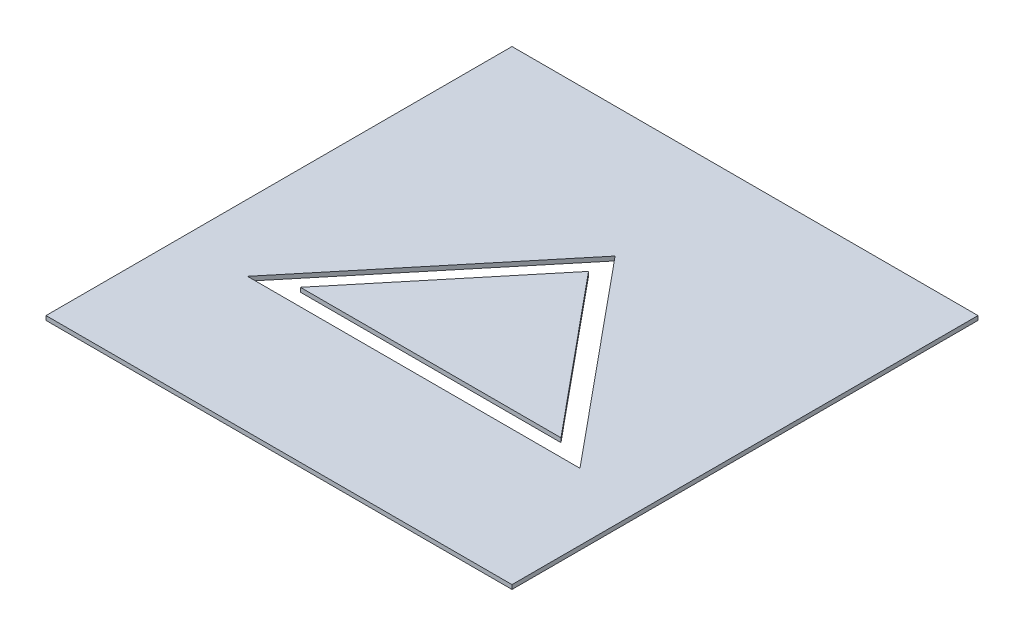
ISO-10303-21;
HEADER;
FILE_DESCRIPTION(('STEP AP214'),'2;1');
FILE_NAME('part.step','',(''),(''),'','','');
FILE_SCHEMA(('AUTOMOTIVE_DESIGN { 1 0 10303 214 1 1 1 1 }'));
ENDSEC;
DATA;
#1=APPLICATION_CONTEXT('core data for automotive mechanical design processes');
#2=APPLICATION_PROTOCOL_DEFINITION('international standard','automotive_design',2000,#1);
#3=PRODUCT_CONTEXT('',#1,'mechanical');
#4=PRODUCT('Part','Part','',(#3));
#5=PRODUCT_RELATED_PRODUCT_CATEGORY('part','',(#4));
#6=PRODUCT_DEFINITION_FORMATION('','',#4);
#7=PRODUCT_DEFINITION_CONTEXT('part definition',#1,'design');
#8=PRODUCT_DEFINITION('design','',#6,#7);
#9=PRODUCT_DEFINITION_SHAPE('','',#8);
#10=(LENGTH_UNIT() NAMED_UNIT(*) SI_UNIT(.MILLI.,.METRE.));
#11=(NAMED_UNIT(*) PLANE_ANGLE_UNIT() SI_UNIT($,.RADIAN.));
#12=(NAMED_UNIT(*) SI_UNIT($,.STERADIAN.) SOLID_ANGLE_UNIT());
#13=UNCERTAINTY_MEASURE_WITH_UNIT(LENGTH_MEASURE(1.E-05),#10,'distance_accuracy_value','');
#14=(GEOMETRIC_REPRESENTATION_CONTEXT(3) GLOBAL_UNCERTAINTY_ASSIGNED_CONTEXT((#13)) GLOBAL_UNIT_ASSIGNED_CONTEXT((#10,
#11,#12)) REPRESENTATION_CONTEXT('',''));
#15=CARTESIAN_POINT('',(0.,0.,0.));
#16=DIRECTION('',(0.,0.,1.));
#17=DIRECTION('',(1.,0.,0.));
#18=AXIS2_PLACEMENT_3D('',#15,#16,#17);
#19=CARTESIAN_POINT('',(0.,2.54,-90.932));
#20=DIRECTION('',(0.,0.,-1.));
#21=DIRECTION('',(-1.,0.,0.));
#22=AXIS2_PLACEMENT_3D('',#19,#20,#21);
#23=PLANE('',#22);
#24=DIRECTION('',(1.,0.,0.));
#25=VECTOR('',#24,1.);
#26=CARTESIAN_POINT('',(0.,0.,-90.932));
#27=LINE('',#26,#25);
#28=CARTESIAN_POINT('',(-217.81910630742,0.,-90.932));
#29=VERTEX_POINT('',#28);
#30=CARTESIAN_POINT('',(-61.5808936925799,0.,-90.932));
#31=VERTEX_POINT('',#30);
#32=EDGE_CURVE('E113',#29,#31,#27,.T.);
#33=ORIENTED_EDGE('',*,*,#32,.T.);
#34=DIRECTION('',(0.,-1.,0.));
#35=VECTOR('',#34,1.);
#36=CARTESIAN_POINT('',(-61.5808936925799,2.54,-90.932));
#37=LINE('',#36,#35);
#38=CARTESIAN_POINT('',(-61.5808936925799,2.54,-90.932));
#39=VERTEX_POINT('',#38);
#40=EDGE_CURVE('E13',#39,#31,#37,.T.);
#41=ORIENTED_EDGE('',*,*,#40,.F.);
#42=DIRECTION('',(1.,0.,0.));
#43=VECTOR('',#42,1.);
#44=CARTESIAN_POINT('',(0.,2.54,-90.932));
#45=LINE('',#44,#43);
#46=CARTESIAN_POINT('',(-217.81910630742,2.54,-90.932));
#47=VERTEX_POINT('',#46);
#48=EDGE_CURVE('E106',#47,#39,#45,.T.);
#49=ORIENTED_EDGE('',*,*,#48,.F.);
#50=DIRECTION('',(0.,-1.,0.));
#51=VECTOR('',#50,1.);
#52=CARTESIAN_POINT('',(-217.81910630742,2.54,-90.932));
#53=LINE('',#52,#51);
#54=EDGE_CURVE('E114',#47,#29,#53,.T.);
#55=ORIENTED_EDGE('',*,*,#54,.T.);
#56=EDGE_LOOP('',(#33,#41,#49,#55));
#57=FACE_BOUND('',#56,.T.);
#58=ADVANCED_FACE('F66',(#57),#23,.F.);
#59=CARTESIAN_POINT('',(8.01939738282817,2.54,-6.62008948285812));
#60=DIRECTION('',(-0.771180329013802,0.,0.636616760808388));
#61=DIRECTION('',(0.636616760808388,0.,0.771180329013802));
#62=AXIS2_PLACEMENT_3D('',#59,#60,#61);
#63=PLANE('',#62);
#64=DIRECTION('',(-0.636616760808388,0.,-0.771180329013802));
#65=VECTOR('',#64,1.);
#66=CARTESIAN_POINT('',(8.01939738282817,0.,-6.62008948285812));
#67=LINE('',#66,#65);
#68=CARTESIAN_POINT('',(-139.7,0.,-185.56337292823));
#69=VERTEX_POINT('',#68);
#70=EDGE_CURVE('E94',#31,#69,#67,.T.);
#71=ORIENTED_EDGE('',*,*,#70,.T.);
#72=DIRECTION('',(0.,-1.,0.));
#73=VECTOR('',#72,1.);
#74=CARTESIAN_POINT('',(-139.7,2.54,-185.56337292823));
#75=LINE('',#74,#73);
#76=CARTESIAN_POINT('',(-139.7,2.54,-185.56337292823));
#77=VERTEX_POINT('',#76);
#78=EDGE_CURVE('E74',#77,#69,#75,.T.);
#79=ORIENTED_EDGE('',*,*,#78,.F.);
#80=DIRECTION('',(-0.636616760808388,0.,-0.771180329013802));
#81=VECTOR('',#80,1.);
#82=CARTESIAN_POINT('',(8.01939738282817,2.54,-6.62008948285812));
#83=LINE('',#82,#81);
#84=EDGE_CURVE('E102',#39,#77,#83,.T.);
#85=ORIENTED_EDGE('',*,*,#84,.F.);
#86=ORIENTED_EDGE('',*,*,#40,.T.);
#87=EDGE_LOOP('',(#71,#79,#85,#86));
#88=FACE_BOUND('',#87,.T.);
#89=ADVANCED_FACE('F103',(#88),#63,.F.);
#90=CARTESIAN_POINT('',(-174.183913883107,2.54,-143.79049214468));
#91=DIRECTION('',(0.771180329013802,0.,0.636616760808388));
#92=DIRECTION('',(0.636616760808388,0.,-0.771180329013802));
#93=AXIS2_PLACEMENT_3D('',#90,#91,#92);
#94=PLANE('',#93);
#95=DIRECTION('',(-0.636616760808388,0.,0.771180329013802));
#96=VECTOR('',#95,1.);
#97=CARTESIAN_POINT('',(-174.183913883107,0.,-143.79049214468));
#98=LINE('',#97,#96);
#99=EDGE_CURVE('E99',#69,#29,#98,.T.);
#100=ORIENTED_EDGE('',*,*,#99,.T.);
#101=ORIENTED_EDGE('',*,*,#54,.F.);
#102=DIRECTION('',(-0.636616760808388,0.,0.771180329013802));
#103=VECTOR('',#102,1.);
#104=CARTESIAN_POINT('',(-174.183913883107,2.54,-143.79049214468));
#105=LINE('',#104,#103);
#106=EDGE_CURVE('E82',#77,#47,#105,.T.);
#107=ORIENTED_EDGE('',*,*,#106,.F.);
#108=ORIENTED_EDGE('',*,*,#78,.T.);
#109=EDGE_LOOP('',(#100,#101,#107,#108));
#110=FACE_BOUND('',#109,.T.);
#111=ADVANCED_FACE('F121',(#110),#94,.F.);
#112=CARTESIAN_POINT('',(0.,2.54,0.));
#113=DIRECTION('',(0.,1.,0.));
#114=DIRECTION('',(0.,0.,1.));
#115=AXIS2_PLACEMENT_3D('',#112,#113,#114);
#116=PLANE('',#115);
#117=ORIENTED_EDGE('',*,*,#48,.T.);
#118=ORIENTED_EDGE('',*,*,#84,.T.);
#119=ORIENTED_EDGE('',*,*,#106,.T.);
#120=EDGE_LOOP('',(#117,#118,#119));
#121=FACE_BOUND('',#120,.T.);
#122=ADVANCED_FACE('F109',(#121),#116,.T.);
#123=CARTESIAN_POINT('',(0.,0.,0.));
#124=DIRECTION('',(0.,1.,0.));
#125=DIRECTION('',(0.,0.,1.));
#126=AXIS2_PLACEMENT_3D('',#123,#124,#125);
#127=PLANE('',#126);
#128=ORIENTED_EDGE('',*,*,#32,.F.);
#129=ORIENTED_EDGE('',*,*,#99,.F.);
#130=ORIENTED_EDGE('',*,*,#70,.F.);
#131=EDGE_LOOP('',(#128,#129,#130));
#132=FACE_BOUND('',#131,.T.);
#133=ADVANCED_FACE('F122',(#132),#127,.F.);
#134=CLOSED_SHELL('',(#58,#89,#111,#122,#133));
#135=MANIFOLD_SOLID_BREP('B2',#134);
#136=CARTESIAN_POINT('',(0.,2.54,-80.772));
#137=DIRECTION('',(0.,0.,1.));
#138=DIRECTION('',(1.,0.,0.));
#139=AXIS2_PLACEMENT_3D('',#136,#137,#138);
#140=PLANE('',#139);
#141=DIRECTION('',(-1.,0.,0.));
#142=VECTOR('',#141,1.);
#143=CARTESIAN_POINT('',(0.,0.,-80.772));
#144=LINE('',#143,#142);
#145=CARTESIAN_POINT('',(-40.0191063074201,0.,-80.772));
#146=VERTEX_POINT('',#145);
#147=CARTESIAN_POINT('',(-239.38089369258,0.,-80.7719999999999));
#148=VERTEX_POINT('',#147);
#149=EDGE_CURVE('E243',#146,#148,#144,.T.);
#150=ORIENTED_EDGE('',*,*,#149,.T.);
#151=DIRECTION('',(0.,-1.,0.));
#152=VECTOR('',#151,1.);
#153=CARTESIAN_POINT('',(-239.38089369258,2.54,-80.7719999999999));
#154=LINE('',#153,#152);
#155=CARTESIAN_POINT('',(-239.38089369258,2.54,-80.7719999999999));
#156=VERTEX_POINT('',#155);
#157=EDGE_CURVE('E64',#156,#148,#154,.T.);
#158=ORIENTED_EDGE('',*,*,#157,.F.);
#159=DIRECTION('',(-1.,0.,0.));
#160=VECTOR('',#159,1.);
#161=CARTESIAN_POINT('',(0.,2.54,-80.772));
#162=LINE('',#161,#160);
#163=CARTESIAN_POINT('',(-40.0191063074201,2.54,-80.772));
#164=VERTEX_POINT('',#163);
#165=EDGE_CURVE('E235',#164,#156,#162,.T.);
#166=ORIENTED_EDGE('',*,*,#165,.F.);
#167=DIRECTION('',(0.,-1.,0.));
#168=VECTOR('',#167,1.);
#169=CARTESIAN_POINT('',(-40.0191063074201,2.54,-80.772));
#170=LINE('',#169,#168);
#171=EDGE_CURVE('E244',#164,#146,#170,.T.);
#172=ORIENTED_EDGE('',*,*,#171,.T.);
#173=EDGE_LOOP('',(#150,#158,#166,#172));
#174=FACE_BOUND('',#173,.T.);
#175=ADVANCED_FACE('F164',(#174),#140,.F.);
#176=CARTESIAN_POINT('',(-182.019106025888,2.54,-150.258518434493));
#177=DIRECTION('',(-0.771180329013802,0.,-0.636616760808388));
#178=DIRECTION('',(-0.636616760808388,0.,0.771180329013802));
#179=AXIS2_PLACEMENT_3D('',#176,#177,#178);
#180=PLANE('',#179);
#181=DIRECTION('',(0.636616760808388,0.,-0.771180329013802));
#182=VECTOR('',#181,1.);
#183=CARTESIAN_POINT('',(-182.019106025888,0.,-150.258518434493));
#184=LINE('',#183,#182);
#185=CARTESIAN_POINT('',(-139.7,0.,-201.522739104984));
#186=VERTEX_POINT('',#185);
#187=EDGE_CURVE('E207',#148,#186,#184,.T.);
#188=ORIENTED_EDGE('',*,*,#187,.T.);
#189=DIRECTION('',(0.,-1.,0.));
#190=VECTOR('',#189,1.);
#191=CARTESIAN_POINT('',(-139.7,2.54,-201.522739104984));
#192=LINE('',#191,#190);
#193=CARTESIAN_POINT('',(-139.7,2.54,-201.522739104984));
#194=VERTEX_POINT('',#193);
#195=EDGE_CURVE('E174',#194,#186,#192,.T.);
#196=ORIENTED_EDGE('',*,*,#195,.F.);
#197=DIRECTION('',(0.636616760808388,0.,-0.771180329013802));
#198=VECTOR('',#197,1.);
#199=CARTESIAN_POINT('',(-182.019106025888,2.54,-150.258518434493));
#200=LINE('',#199,#198);
#201=EDGE_CURVE('E231',#156,#194,#200,.T.);
#202=ORIENTED_EDGE('',*,*,#201,.F.);
#203=ORIENTED_EDGE('',*,*,#157,.T.);
#204=EDGE_LOOP('',(#188,#196,#202,#203));
#205=FACE_BOUND('',#204,.T.);
#206=ADVANCED_FACE('F232',(#205),#180,.F.);
#207=CARTESIAN_POINT('',(-279.4,2.54,0.));
#208=DIRECTION('',(-1.,0.,0.));
#209=DIRECTION('',(0.,0.,1.));
#210=AXIS2_PLACEMENT_3D('',#207,#208,#209);
#211=PLANE('',#210);
#212=DIRECTION('',(0.,0.,-1.));
#213=VECTOR('',#212,1.);
#214=CARTESIAN_POINT('',(-279.4,0.,0.));
#215=LINE('',#214,#213);
#216=CARTESIAN_POINT('',(-279.4,0.,0.));
#217=VERTEX_POINT('',#216);
#218=CARTESIAN_POINT('',(-279.4,0.,-279.4));
#219=VERTEX_POINT('',#218);
#220=EDGE_CURVE('E275',#217,#219,#215,.T.);
#221=ORIENTED_EDGE('',*,*,#220,.F.);
#222=DIRECTION('',(0.,-1.,0.));
#223=VECTOR('',#222,1.);
#224=CARTESIAN_POINT('',(-279.4,2.54,0.));
#225=LINE('',#224,#223);
#226=CARTESIAN_POINT('',(-279.4,2.54,0.));
#227=VERTEX_POINT('',#226);
#228=EDGE_CURVE('E168',#227,#217,#225,.T.);
#229=ORIENTED_EDGE('',*,*,#228,.F.);
#230=DIRECTION('',(0.,0.,-1.));
#231=VECTOR('',#230,1.);
#232=CARTESIAN_POINT('',(-279.4,2.54,0.));
#233=LINE('',#232,#231);
#234=CARTESIAN_POINT('',(-279.4,2.54,-279.4));
#235=VERTEX_POINT('',#234);
#236=EDGE_CURVE('E255',#227,#235,#233,.T.);
#237=ORIENTED_EDGE('',*,*,#236,.T.);
#238=DIRECTION('',(0.,-1.,0.));
#239=VECTOR('',#238,1.);
#240=CARTESIAN_POINT('',(-279.4,2.54,-279.4));
#241=LINE('',#240,#239);
#242=EDGE_CURVE('E258',#235,#219,#241,.T.);
#243=ORIENTED_EDGE('',*,*,#242,.T.);
#244=EDGE_LOOP('',(#221,#229,#237,#243));
#245=FACE_BOUND('',#244,.T.);
#246=ADVANCED_FACE('F166',(#245),#211,.T.);
#247=CARTESIAN_POINT('',(0.,2.54,0.));
#248=DIRECTION('',(0.,0.,1.));
#249=DIRECTION('',(1.,0.,0.));
#250=AXIS2_PLACEMENT_3D('',#247,#248,#249);
#251=PLANE('',#250);
#252=DIRECTION('',(-1.,0.,0.));
#253=VECTOR('',#252,1.);
#254=CARTESIAN_POINT('',(0.,0.,0.));
#255=LINE('',#254,#253);
#256=CARTESIAN_POINT('',(0.,0.,0.));
#257=VERTEX_POINT('',#256);
#258=EDGE_CURVE('E271',#257,#217,#255,.T.);
#259=ORIENTED_EDGE('',*,*,#258,.F.);
#260=DIRECTION('',(0.,-1.,0.));
#261=VECTOR('',#260,1.);
#262=CARTESIAN_POINT('',(0.,2.54,0.));
#263=LINE('',#262,#261);
#264=CARTESIAN_POINT('',(0.,2.54,0.));
#265=VERTEX_POINT('',#264);
#266=EDGE_CURVE('E262',#265,#257,#263,.T.);
#267=ORIENTED_EDGE('',*,*,#266,.F.);
#268=DIRECTION('',(-1.,0.,0.));
#269=VECTOR('',#268,1.);
#270=CARTESIAN_POINT('',(0.,2.54,0.));
#271=LINE('',#270,#269);
#272=EDGE_CURVE('E273',#265,#227,#271,.T.);
#273=ORIENTED_EDGE('',*,*,#272,.T.);
#274=ORIENTED_EDGE('',*,*,#228,.T.);
#275=EDGE_LOOP('',(#259,#267,#273,#274));
#276=FACE_BOUND('',#275,.T.);
#277=ADVANCED_FACE('F269',(#276),#251,.T.);
#278=CARTESIAN_POINT('',(0.,2.54,0.));
#279=DIRECTION('',(-1.,0.,0.));
#280=DIRECTION('',(0.,0.,1.));
#281=AXIS2_PLACEMENT_3D('',#278,#279,#280);
#282=PLANE('',#281);
#283=DIRECTION('',(0.,0.,-1.));
#284=VECTOR('',#283,1.);
#285=CARTESIAN_POINT('',(0.,0.,0.));
#286=LINE('',#285,#284);
#287=CARTESIAN_POINT('',(0.,0.,-279.4));
#288=VERTEX_POINT('',#287);
#289=EDGE_CURVE('E250',#257,#288,#286,.T.);
#290=ORIENTED_EDGE('',*,*,#289,.T.);
#291=DIRECTION('',(0.,-1.,0.));
#292=VECTOR('',#291,1.);
#293=CARTESIAN_POINT('',(0.,2.54,-279.4));
#294=LINE('',#293,#292);
#295=CARTESIAN_POINT('',(0.,2.54,-279.4));
#296=VERTEX_POINT('',#295);
#297=EDGE_CURVE('E260',#296,#288,#294,.T.);
#298=ORIENTED_EDGE('',*,*,#297,.F.);
#299=DIRECTION('',(0.,0.,-1.));
#300=VECTOR('',#299,1.);
#301=CARTESIAN_POINT('',(0.,2.54,0.));
#302=LINE('',#301,#300);
#303=EDGE_CURVE('E285',#265,#296,#302,.T.);
#304=ORIENTED_EDGE('',*,*,#303,.F.);
#305=ORIENTED_EDGE('',*,*,#266,.T.);
#306=EDGE_LOOP('',(#290,#298,#304,#305));
#307=FACE_BOUND('',#306,.T.);
#308=ADVANCED_FACE('F293',(#307),#282,.F.);
#309=CARTESIAN_POINT('',(0.,2.54,-279.4));
#310=DIRECTION('',(0.,0.,1.));
#311=DIRECTION('',(1.,0.,0.));
#312=AXIS2_PLACEMENT_3D('',#309,#310,#311);
#313=PLANE('',#312);
#314=DIRECTION('',(-1.,0.,0.));
#315=VECTOR('',#314,1.);
#316=CARTESIAN_POINT('',(0.,0.,-279.4));
#317=LINE('',#316,#315);
#318=EDGE_CURVE('E246',#288,#219,#317,.T.);
#319=ORIENTED_EDGE('',*,*,#318,.T.);
#320=ORIENTED_EDGE('',*,*,#242,.F.);
#321=DIRECTION('',(-1.,0.,0.));
#322=VECTOR('',#321,1.);
#323=CARTESIAN_POINT('',(0.,2.54,-279.4));
#324=LINE('',#323,#322);
#325=EDGE_CURVE('E240',#296,#235,#324,.T.);
#326=ORIENTED_EDGE('',*,*,#325,.F.);
#327=ORIENTED_EDGE('',*,*,#297,.T.);
#328=EDGE_LOOP('',(#319,#320,#326,#327));
#329=FACE_BOUND('',#328,.T.);
#330=ADVANCED_FACE('F292',(#329),#313,.F.);
#331=CARTESIAN_POINT('',(15.8545895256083,2.54,-13.0881157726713));
#332=DIRECTION('',(0.771180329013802,0.,-0.636616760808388));
#333=DIRECTION('',(-0.636616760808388,0.,-0.771180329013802));
#334=AXIS2_PLACEMENT_3D('',#331,#332,#333);
#335=PLANE('',#334);
#336=DIRECTION('',(0.636616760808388,0.,0.771180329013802));
#337=VECTOR('',#336,1.);
#338=CARTESIAN_POINT('',(15.8545895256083,0.,-13.0881157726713));
#339=LINE('',#338,#337);
#340=EDGE_CURVE('E213',#186,#146,#339,.T.);
#341=ORIENTED_EDGE('',*,*,#340,.T.);
#342=ORIENTED_EDGE('',*,*,#171,.F.);
#343=DIRECTION('',(0.636616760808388,0.,0.771180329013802));
#344=VECTOR('',#343,1.);
#345=CARTESIAN_POINT('',(15.8545895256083,2.54,-13.0881157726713));
#346=LINE('',#345,#344);
#347=EDGE_CURVE('E183',#194,#164,#346,.T.);
#348=ORIENTED_EDGE('',*,*,#347,.F.);
#349=ORIENTED_EDGE('',*,*,#195,.T.);
#350=EDGE_LOOP('',(#341,#342,#348,#349));
#351=FACE_BOUND('',#350,.T.);
#352=ADVANCED_FACE('F300',(#351),#335,.F.);
#353=CARTESIAN_POINT('',(0.,2.54,0.));
#354=DIRECTION('',(0.,1.,0.));
#355=DIRECTION('',(0.,0.,1.));
#356=AXIS2_PLACEMENT_3D('',#353,#354,#355);
#357=PLANE('',#356);
#358=ORIENTED_EDGE('',*,*,#236,.F.);
#359=ORIENTED_EDGE('',*,*,#272,.F.);
#360=ORIENTED_EDGE('',*,*,#303,.T.);
#361=ORIENTED_EDGE('',*,*,#325,.T.);
#362=EDGE_LOOP('',(#358,#359,#360,#361));
#363=FACE_BOUND('',#362,.T.);
#364=ORIENTED_EDGE('',*,*,#165,.T.);
#365=ORIENTED_EDGE('',*,*,#201,.T.);
#366=ORIENTED_EDGE('',*,*,#347,.T.);
#367=EDGE_LOOP('',(#364,#365,#366));
#368=FACE_BOUND('',#367,.T.);
#369=ADVANCED_FACE('F238',(#363,#368),#357,.T.);
#370=CARTESIAN_POINT('',(0.,0.,0.));
#371=DIRECTION('',(0.,1.,0.));
#372=DIRECTION('',(0.,0.,1.));
#373=AXIS2_PLACEMENT_3D('',#370,#371,#372);
#374=PLANE('',#373);
#375=ORIENTED_EDGE('',*,*,#220,.T.);
#376=ORIENTED_EDGE('',*,*,#318,.F.);
#377=ORIENTED_EDGE('',*,*,#289,.F.);
#378=ORIENTED_EDGE('',*,*,#258,.T.);
#379=EDGE_LOOP('',(#375,#376,#377,#378));
#380=FACE_BOUND('',#379,.T.);
#381=ORIENTED_EDGE('',*,*,#149,.F.);
#382=ORIENTED_EDGE('',*,*,#340,.F.);
#383=ORIENTED_EDGE('',*,*,#187,.F.);
#384=EDGE_LOOP('',(#381,#382,#383));
#385=FACE_BOUND('',#384,.T.);
#386=ADVANCED_FACE('F280',(#380,#385),#374,.F.);
#387=CLOSED_SHELL('',(#175,#206,#246,#277,#308,#330,#352,#369,#386));
#388=MANIFOLD_SOLID_BREP('B7',#387);
#389=ADVANCED_BREP_SHAPE_REPRESENTATION('',(#18,#135,#388),#14);
#390=SHAPE_DEFINITION_REPRESENTATION(#9,#389);
ENDSEC;
END-ISO-10303-21;
